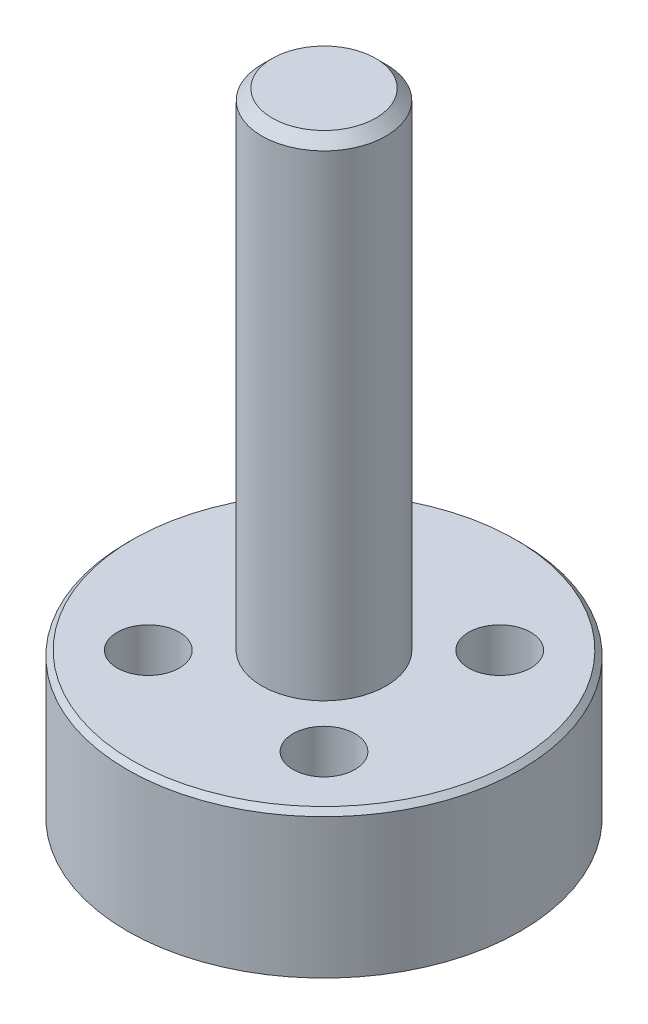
from build123d import *

# Parameters (mm, degrees)
SKETCH1_R           = 9.5
SKETCH1_R_2         = 1.5
BOSS_EXTRUDE1_DEPTH = 7
SKETCH2_R           = 3
BOSS_EXTRUDE2_DEPTH = 23.5
CHAMFER1_SIZE       = 0.5
CHAMFER2_SIZE       = 0.25
SKETCH3_R           = 2.5
CUT_EXTRUDE1_DEPTH  = 5


with BuildPart() as part:
    # Sketch1 → Boss-Extrude1 (new body)
    with BuildSketch(Plane(origin=(0, 0, 0), x_dir=(1, 0, 0), z_dir=(0, 1, 0))):
        with Locations(Location((0, 0, 0), (0, 0, 270))):
            Circle(SKETCH1_R)
        with Locations(Location((4.242640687, 4.242640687, 0), (0, 0, 270))):
            Circle(SKETCH1_R_2, mode=Mode.SUBTRACT)
        with Locations(Location((-4.242640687, 4.242640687, 0), (0, 0, 270))):
            Circle(SKETCH1_R_2, mode=Mode.SUBTRACT)
        with Locations(Location((-4.242640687, -4.242640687, 0), (0, 0, 270))):
            Circle(SKETCH1_R_2, mode=Mode.SUBTRACT)
        with Locations(Location((4.242640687, -4.242640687, 0), (0, 0, 270))):
            Circle(SKETCH1_R_2, mode=Mode.SUBTRACT)
    extrude(amount=BOSS_EXTRUDE1_DEPTH)

    # Sketch2 → Boss-Extrude2 (add)
    with BuildSketch(Plane(origin=(0, 7, 0), x_dir=(1, 0, 0), z_dir=(0, 1, 0))):
        with Locations(Location((0, 0, 0), (0, 0, 270))):
            Circle(SKETCH2_R)
    extrude(amount=BOSS_EXTRUDE2_DEPTH)

    # Chamfer1
    chamfer1_edges = [part.edges().sort_by_distance(p)[0] for p in [
        (0, 30.5, -3),
    ]]
    chamfer(chamfer1_edges, length=CHAMFER1_SIZE)

    # Chamfer2
    chamfer2_edges = [part.edges().sort_by_distance(p)[0] for p in [
        (0, 7, -9.5),
    ]]
    chamfer(chamfer2_edges, length=CHAMFER2_SIZE)

    # Sketch3 → Cut-Extrude1 (cut)
    with BuildSketch(Plane.XZ):
        with Locations(Location((0, 0, 0), (0, 0, 270))):
            Circle(SKETCH3_R)
    extrude(amount=-CUT_EXTRUDE1_DEPTH, mode=Mode.SUBTRACT)


solid = part.part
